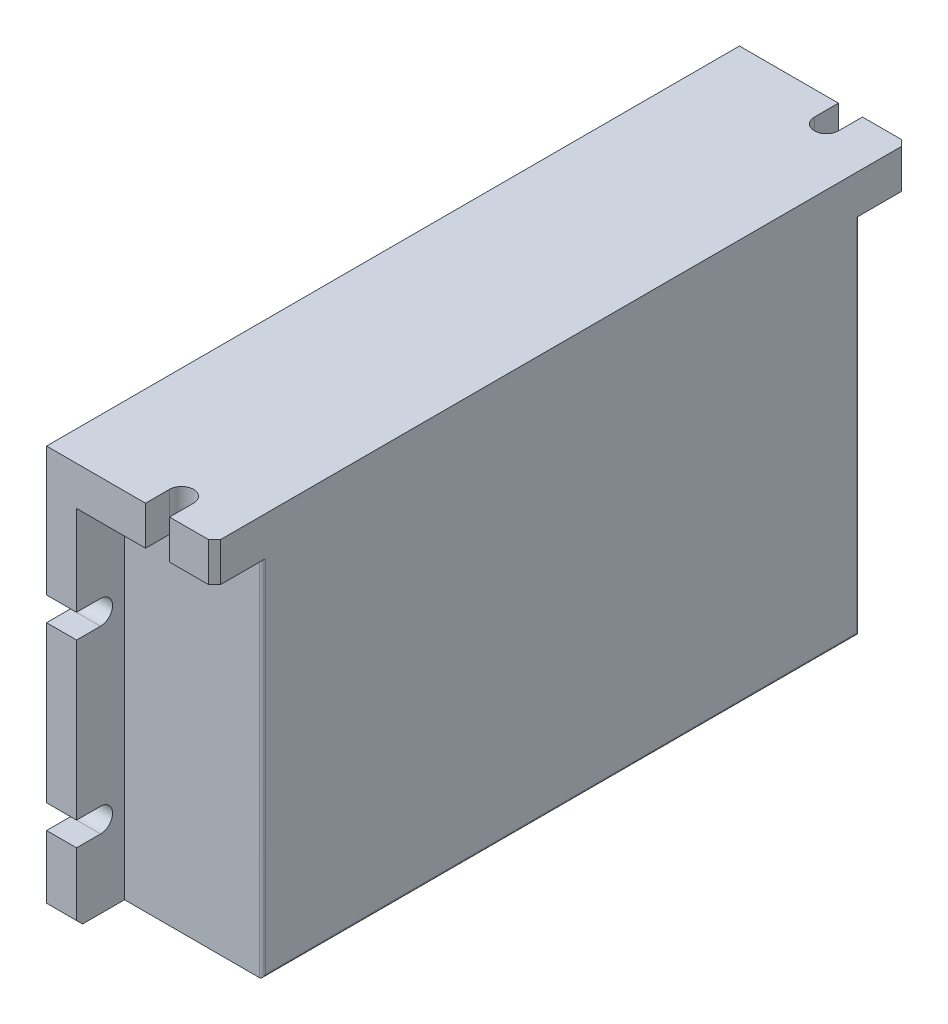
ISO-10303-21;
HEADER;
FILE_DESCRIPTION(('STEP AP214'),'2;1');
FILE_NAME('part.step','',(''),(''),'','','');
FILE_SCHEMA(('AUTOMOTIVE_DESIGN { 1 0 10303 214 1 1 1 1 }'));
ENDSEC;
DATA;
#1=APPLICATION_CONTEXT('core data for automotive mechanical design processes');
#2=APPLICATION_PROTOCOL_DEFINITION('international standard','automotive_design',2000,#1);
#3=PRODUCT_CONTEXT('',#1,'mechanical');
#4=PRODUCT('Part','Part','',(#3));
#5=PRODUCT_RELATED_PRODUCT_CATEGORY('part','',(#4));
#6=PRODUCT_DEFINITION_FORMATION('','',#4);
#7=PRODUCT_DEFINITION_CONTEXT('part definition',#1,'design');
#8=PRODUCT_DEFINITION('design','',#6,#7);
#9=PRODUCT_DEFINITION_SHAPE('','',#8);
#10=(LENGTH_UNIT() NAMED_UNIT(*) SI_UNIT(.MILLI.,.METRE.));
#11=(NAMED_UNIT(*) PLANE_ANGLE_UNIT() SI_UNIT($,.RADIAN.));
#12=(NAMED_UNIT(*) SI_UNIT($,.STERADIAN.) SOLID_ANGLE_UNIT());
#13=UNCERTAINTY_MEASURE_WITH_UNIT(LENGTH_MEASURE(1.E-05),#10,'distance_accuracy_value','');
#14=(GEOMETRIC_REPRESENTATION_CONTEXT(3) GLOBAL_UNCERTAINTY_ASSIGNED_CONTEXT((#13)) GLOBAL_UNIT_ASSIGNED_CONTEXT((#10,
#11,#12)) REPRESENTATION_CONTEXT('',''));
#15=CARTESIAN_POINT('',(0.,0.,0.));
#16=DIRECTION('',(0.,0.,1.));
#17=DIRECTION('',(1.,0.,0.));
#18=AXIS2_PLACEMENT_3D('',#15,#16,#17);
#19=CARTESIAN_POINT('',(28.,-33.5,-57.75));
#20=DIRECTION('',(0.,0.,1.));
#21=DIRECTION('',(1.,0.,0.));
#22=AXIS2_PLACEMENT_3D('',#19,#20,#21);
#23=PLANE('',#22);
#24=DIRECTION('',(0.,1.,0.));
#25=VECTOR('',#24,1.);
#26=CARTESIAN_POINT('',(5.,-33.5,-57.75));
#27=LINE('',#26,#25);
#28=CARTESIAN_POINT('',(5.,12.,-57.75));
#29=VERTEX_POINT('',#28);
#30=CARTESIAN_POINT('',(5.,27.,-57.75));
#31=VERTEX_POINT('',#30);
#32=EDGE_CURVE('E471',#29,#31,#27,.T.);
#33=ORIENTED_EDGE('',*,*,#32,.F.);
#34=DIRECTION('',(1.,0.,0.));
#35=VECTOR('',#34,1.);
#36=CARTESIAN_POINT('',(0.,12.,-57.75));
#37=LINE('',#36,#35);
#38=CARTESIAN_POINT('',(0.,12.,-57.75));
#39=VERTEX_POINT('',#38);
#40=EDGE_CURVE('E330',#39,#29,#37,.T.);
#41=ORIENTED_EDGE('',*,*,#40,.F.);
#42=DIRECTION('',(0.,1.,0.));
#43=VECTOR('',#42,1.);
#44=CARTESIAN_POINT('',(0.,-33.5,-57.75));
#45=LINE('',#44,#43);
#46=CARTESIAN_POINT('',(0.,33.5,-57.75));
#47=VERTEX_POINT('',#46);
#48=EDGE_CURVE('E510',#39,#47,#45,.T.);
#49=ORIENTED_EDGE('',*,*,#48,.T.);
#50=DIRECTION('',(-1.,0.,0.));
#51=VECTOR('',#50,1.);
#52=CARTESIAN_POINT('',(28.,33.5,-57.75));
#53=LINE('',#52,#51);
#54=CARTESIAN_POINT('',(16.5,33.5,-57.75));
#55=VERTEX_POINT('',#54);
#56=EDGE_CURVE('E537',#55,#47,#53,.T.);
#57=ORIENTED_EDGE('',*,*,#56,.F.);
#58=DIRECTION('',(0.,1.,0.));
#59=VECTOR('',#58,1.);
#60=CARTESIAN_POINT('',(16.5,27.,-57.75));
#61=LINE('',#60,#59);
#62=CARTESIAN_POINT('',(16.5,27.,-57.75));
#63=VERTEX_POINT('',#62);
#64=EDGE_CURVE('E461',#63,#55,#61,.T.);
#65=ORIENTED_EDGE('',*,*,#64,.F.);
#66=DIRECTION('',(1.,0.,0.));
#67=VECTOR('',#66,1.);
#68=CARTESIAN_POINT('',(5.,27.,-57.75));
#69=LINE('',#68,#67);
#70=EDGE_CURVE('E489',#31,#63,#69,.T.);
#71=ORIENTED_EDGE('',*,*,#70,.F.);
#72=EDGE_LOOP('',(#33,#41,#49,#57,#65,#71));
#73=FACE_BOUND('',#72,.T.);
#74=ADVANCED_FACE('F35',(#73),#23,.F.);
#75=CARTESIAN_POINT('',(0.,-18.,-57.75));
#76=VERTEX_POINT('',#75);
#77=CARTESIAN_POINT('',(0.,7.99999999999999,-57.75));
#78=VERTEX_POINT('',#77);
#79=EDGE_CURVE('E525',#76,#78,#45,.T.);
#80=ORIENTED_EDGE('',*,*,#79,.T.);
#81=DIRECTION('',(1.,0.,0.));
#82=VECTOR('',#81,1.);
#83=CARTESIAN_POINT('',(0.,7.99999999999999,-57.75));
#84=LINE('',#83,#82);
#85=CARTESIAN_POINT('',(5.,7.99999999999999,-57.75));
#86=VERTEX_POINT('',#85);
#87=EDGE_CURVE('E303',#78,#86,#84,.T.);
#88=ORIENTED_EDGE('',*,*,#87,.T.);
#89=CARTESIAN_POINT('',(5.,-18.,-57.75));
#90=VERTEX_POINT('',#89);
#91=EDGE_CURVE('E470',#90,#86,#27,.T.);
#92=ORIENTED_EDGE('',*,*,#91,.F.);
#93=DIRECTION('',(1.,0.,0.));
#94=VECTOR('',#93,1.);
#95=CARTESIAN_POINT('',(0.,-18.,-57.75));
#96=LINE('',#95,#94);
#97=EDGE_CURVE('E353',#76,#90,#96,.T.);
#98=ORIENTED_EDGE('',*,*,#97,.F.);
#99=EDGE_LOOP('',(#80,#88,#92,#98));
#100=FACE_BOUND('',#99,.T.);
#101=ADVANCED_FACE('F629',(#100),#23,.F.);
#102=CARTESIAN_POINT('',(28.,-33.5,57.75));
#103=DIRECTION('',(0.,0.,-1.));
#104=DIRECTION('',(-1.,0.,0.));
#105=AXIS2_PLACEMENT_3D('',#102,#103,#104);
#106=PLANE('',#105);
#107=DIRECTION('',(0.,-1.,0.));
#108=VECTOR('',#107,1.);
#109=CARTESIAN_POINT('',(5.,-33.5,57.75));
#110=LINE('',#109,#108);
#111=CARTESIAN_POINT('',(5.,7.99999999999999,57.75));
#112=VERTEX_POINT('',#111);
#113=CARTESIAN_POINT('',(5.,-18.,57.75));
#114=VERTEX_POINT('',#113);
#115=EDGE_CURVE('E496',#112,#114,#110,.T.);
#116=ORIENTED_EDGE('',*,*,#115,.F.);
#117=DIRECTION('',(1.,0.,0.));
#118=VECTOR('',#117,1.);
#119=CARTESIAN_POINT('',(0.,7.99999999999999,57.75));
#120=LINE('',#119,#118);
#121=CARTESIAN_POINT('',(0.,7.99999999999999,57.75));
#122=VERTEX_POINT('',#121);
#123=EDGE_CURVE('E379',#122,#112,#120,.T.);
#124=ORIENTED_EDGE('',*,*,#123,.F.);
#125=DIRECTION('',(0.,-1.,0.));
#126=VECTOR('',#125,1.);
#127=CARTESIAN_POINT('',(0.,-33.5,57.75));
#128=LINE('',#127,#126);
#129=CARTESIAN_POINT('',(0.,-18.,57.75));
#130=VERTEX_POINT('',#129);
#131=EDGE_CURVE('E532',#122,#130,#128,.T.);
#132=ORIENTED_EDGE('',*,*,#131,.T.);
#133=DIRECTION('',(1.,0.,0.));
#134=VECTOR('',#133,1.);
#135=CARTESIAN_POINT('',(0.,-18.,57.75));
#136=LINE('',#135,#134);
#137=EDGE_CURVE('E408',#130,#114,#136,.T.);
#138=ORIENTED_EDGE('',*,*,#137,.T.);
#139=EDGE_LOOP('',(#116,#124,#132,#138));
#140=FACE_BOUND('',#139,.T.);
#141=ADVANCED_FACE('F703',(#140),#106,.F.);
#142=CARTESIAN_POINT('',(0.,-22.,57.75));
#143=VERTEX_POINT('',#142);
#144=CARTESIAN_POINT('',(0.,-32.5,57.75));
#145=VERTEX_POINT('',#144);
#146=EDGE_CURVE('E528',#143,#145,#128,.T.);
#147=ORIENTED_EDGE('',*,*,#146,.T.);
#148=DIRECTION('',(1.,0.,0.));
#149=VECTOR('',#148,1.);
#150=CARTESIAN_POINT('',(28.,-32.5,57.75));
#151=LINE('',#150,#149);
#152=CARTESIAN_POINT('',(5.,-32.5,57.75));
#153=VERTEX_POINT('',#152);
#154=EDGE_CURVE('E578',#145,#153,#151,.T.);
#155=ORIENTED_EDGE('',*,*,#154,.T.);
#156=CARTESIAN_POINT('',(5.,-22.,57.75));
#157=VERTEX_POINT('',#156);
#158=EDGE_CURVE('E497',#157,#153,#110,.T.);
#159=ORIENTED_EDGE('',*,*,#158,.F.);
#160=DIRECTION('',(1.,0.,0.));
#161=VECTOR('',#160,1.);
#162=CARTESIAN_POINT('',(0.,-22.,57.75));
#163=LINE('',#162,#161);
#164=EDGE_CURVE('E406',#143,#157,#163,.T.);
#165=ORIENTED_EDGE('',*,*,#164,.F.);
#166=EDGE_LOOP('',(#147,#155,#159,#165));
#167=FACE_BOUND('',#166,.T.);
#168=ADVANCED_FACE('F718',(#167),#106,.F.);
#169=DIRECTION('',(1.,0.,0.));
#170=VECTOR('',#169,1.);
#171=CARTESIAN_POINT('',(5.,27.,57.75));
#172=LINE('',#171,#170);
#173=CARTESIAN_POINT('',(20.5,27.,57.75));
#174=VERTEX_POINT('',#173);
#175=CARTESIAN_POINT('',(27.,27.,57.75));
#176=VERTEX_POINT('',#175);
#177=EDGE_CURVE('E511',#174,#176,#172,.T.);
#178=ORIENTED_EDGE('',*,*,#177,.T.);
#179=DIRECTION('',(0.,1.,0.));
#180=VECTOR('',#179,1.);
#181=CARTESIAN_POINT('',(27.,-33.5,57.75));
#182=LINE('',#181,#180);
#183=CARTESIAN_POINT('',(27.,33.5,57.75));
#184=VERTEX_POINT('',#183);
#185=EDGE_CURVE('E11',#176,#184,#182,.T.);
#186=ORIENTED_EDGE('',*,*,#185,.T.);
#187=DIRECTION('',(-1.,0.,0.));
#188=VECTOR('',#187,1.);
#189=CARTESIAN_POINT('',(28.,33.5,57.75));
#190=LINE('',#189,#188);
#191=CARTESIAN_POINT('',(20.5,33.5,57.75));
#192=VERTEX_POINT('',#191);
#193=EDGE_CURVE('E535',#184,#192,#190,.T.);
#194=ORIENTED_EDGE('',*,*,#193,.T.);
#195=DIRECTION('',(0.,1.,0.));
#196=VECTOR('',#195,1.);
#197=CARTESIAN_POINT('',(20.5,27.,57.75));
#198=LINE('',#197,#196);
#199=EDGE_CURVE('E433',#174,#192,#198,.T.);
#200=ORIENTED_EDGE('',*,*,#199,.F.);
#201=EDGE_LOOP('',(#178,#186,#194,#200));
#202=FACE_BOUND('',#201,.T.);
#203=ADVANCED_FACE('F749',(#202),#106,.F.);
#204=CARTESIAN_POINT('',(5.,-32.5,-57.75));
#205=VERTEX_POINT('',#204);
#206=CARTESIAN_POINT('',(5.,-22.,-57.75));
#207=VERTEX_POINT('',#206);
#208=EDGE_CURVE('E467',#205,#207,#27,.T.);
#209=ORIENTED_EDGE('',*,*,#208,.F.);
#210=DIRECTION('',(-1.,0.,0.));
#211=VECTOR('',#210,1.);
#212=CARTESIAN_POINT('',(28.,-32.5,-57.75));
#213=LINE('',#212,#211);
#214=CARTESIAN_POINT('',(0.,-32.5,-57.75));
#215=VERTEX_POINT('',#214);
#216=EDGE_CURVE('E559',#205,#215,#213,.T.);
#217=ORIENTED_EDGE('',*,*,#216,.T.);
#218=CARTESIAN_POINT('',(0.,-22.,-57.75));
#219=VERTEX_POINT('',#218);
#220=EDGE_CURVE('E522',#215,#219,#45,.T.);
#221=ORIENTED_EDGE('',*,*,#220,.T.);
#222=DIRECTION('',(1.,0.,0.));
#223=VECTOR('',#222,1.);
#224=CARTESIAN_POINT('',(0.,-22.,-57.75));
#225=LINE('',#224,#223);
#226=EDGE_CURVE('E355',#219,#207,#225,.T.);
#227=ORIENTED_EDGE('',*,*,#226,.T.);
#228=EDGE_LOOP('',(#209,#217,#221,#227));
#229=FACE_BOUND('',#228,.T.);
#230=ADVANCED_FACE('F647',(#229),#23,.F.);
#231=CARTESIAN_POINT('',(27.,33.5,-57.75));
#232=VERTEX_POINT('',#231);
#233=CARTESIAN_POINT('',(20.5,33.5,-57.75));
#234=VERTEX_POINT('',#233);
#235=EDGE_CURVE('E538',#232,#234,#53,.T.);
#236=ORIENTED_EDGE('',*,*,#235,.F.);
#237=DIRECTION('',(0.,-1.,0.));
#238=VECTOR('',#237,1.);
#239=CARTESIAN_POINT('',(27.,-33.5,-57.75));
#240=LINE('',#239,#238);
#241=CARTESIAN_POINT('',(27.,27.,-57.75));
#242=VERTEX_POINT('',#241);
#243=EDGE_CURVE('E57',#232,#242,#240,.T.);
#244=ORIENTED_EDGE('',*,*,#243,.T.);
#245=CARTESIAN_POINT('',(20.5,27.,-57.75));
#246=VERTEX_POINT('',#245);
#247=EDGE_CURVE('E480',#246,#242,#69,.T.);
#248=ORIENTED_EDGE('',*,*,#247,.F.);
#249=DIRECTION('',(0.,1.,0.));
#250=VECTOR('',#249,1.);
#251=CARTESIAN_POINT('',(20.5,27.,-57.75));
#252=LINE('',#251,#250);
#253=EDGE_CURVE('E463',#246,#234,#252,.T.);
#254=ORIENTED_EDGE('',*,*,#253,.T.);
#255=EDGE_LOOP('',(#236,#244,#248,#254));
#256=FACE_BOUND('',#255,.T.);
#257=ADVANCED_FACE('F609',(#256),#23,.F.);
#258=CARTESIAN_POINT('',(28.,33.5,57.75));
#259=DIRECTION('',(0.,-1.,0.));
#260=DIRECTION('',(0.,0.,-1.));
#261=AXIS2_PLACEMENT_3D('',#258,#259,#260);
#262=PLANE('',#261);
#263=DIRECTION('',(0.,0.,1.));
#264=VECTOR('',#263,1.);
#265=CARTESIAN_POINT('',(28.,33.5,57.75));
#266=LINE('',#265,#264);
#267=CARTESIAN_POINT('',(28.,33.5,-56.7499999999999));
#268=VERTEX_POINT('',#267);
#269=CARTESIAN_POINT('',(28.,33.5,56.75));
#270=VERTEX_POINT('',#269);
#271=EDGE_CURVE('E517',#268,#270,#266,.T.);
#272=ORIENTED_EDGE('',*,*,#271,.F.);
#273=DIRECTION('',(0.707106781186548,0.,0.707106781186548));
#274=VECTOR('',#273,1.);
#275=CARTESIAN_POINT('',(28.,33.5,-56.75));
#276=LINE('',#275,#274);
#277=EDGE_CURVE('E590',#268,#232,#276,.F.);
#278=ORIENTED_EDGE('',*,*,#277,.T.);
#279=ORIENTED_EDGE('',*,*,#235,.T.);
#280=DIRECTION('',(0.,0.,-1.));
#281=VECTOR('',#280,1.);
#282=CARTESIAN_POINT('',(20.5,33.5,-57.75));
#283=LINE('',#282,#281);
#284=CARTESIAN_POINT('',(20.5,33.5,-53.75));
#285=VERTEX_POINT('',#284);
#286=EDGE_CURVE('E453',#285,#234,#283,.T.);
#287=ORIENTED_EDGE('',*,*,#286,.F.);
#288=CARTESIAN_POINT('',(18.5,33.5,-53.75));
#289=DIRECTION('',(0.,1.,0.));
#290=DIRECTION('',(0.,0.,1.));
#291=AXIS2_PLACEMENT_3D('',#288,#289,#290);
#292=CIRCLE('',#291,2.);
#293=CARTESIAN_POINT('',(16.5,33.5,-53.75));
#294=VERTEX_POINT('',#293);
#295=EDGE_CURVE('E432',#294,#285,#292,.T.);
#296=ORIENTED_EDGE('',*,*,#295,.F.);
#297=DIRECTION('',(0.,0.,1.));
#298=VECTOR('',#297,1.);
#299=CARTESIAN_POINT('',(16.5,33.5,-53.75));
#300=LINE('',#299,#298);
#301=EDGE_CURVE('E444',#55,#294,#300,.T.);
#302=ORIENTED_EDGE('',*,*,#301,.F.);
#303=ORIENTED_EDGE('',*,*,#56,.T.);
#304=DIRECTION('',(0.,0.,1.));
#305=VECTOR('',#304,1.);
#306=CARTESIAN_POINT('',(0.,33.5,57.75));
#307=LINE('',#306,#305);
#308=CARTESIAN_POINT('',(0.,33.5,57.75));
#309=VERTEX_POINT('',#308);
#310=EDGE_CURVE('E524',#47,#309,#307,.T.);
#311=ORIENTED_EDGE('',*,*,#310,.T.);
#312=CARTESIAN_POINT('',(16.5,33.5,57.75));
#313=VERTEX_POINT('',#312);
#314=EDGE_CURVE('E520',#313,#309,#190,.T.);
#315=ORIENTED_EDGE('',*,*,#314,.F.);
#316=DIRECTION('',(0.,0.,1.));
#317=VECTOR('',#316,1.);
#318=CARTESIAN_POINT('',(16.5,33.5,53.75));
#319=LINE('',#318,#317);
#320=CARTESIAN_POINT('',(16.5,33.5,53.75));
#321=VERTEX_POINT('',#320);
#322=EDGE_CURVE('E426',#321,#313,#319,.T.);
#323=ORIENTED_EDGE('',*,*,#322,.F.);
#324=CARTESIAN_POINT('',(18.5,33.5,53.75));
#325=DIRECTION('',(0.,1.,0.));
#326=DIRECTION('',(0.,0.,1.));
#327=AXIS2_PLACEMENT_3D('',#324,#325,#326);
#328=CIRCLE('',#327,2.);
#329=CARTESIAN_POINT('',(20.5,33.5,53.75));
#330=VERTEX_POINT('',#329);
#331=EDGE_CURVE('E405',#330,#321,#328,.T.);
#332=ORIENTED_EDGE('',*,*,#331,.F.);
#333=DIRECTION('',(0.,0.,-1.));
#334=VECTOR('',#333,1.);
#335=CARTESIAN_POINT('',(20.5,33.5,57.75));
#336=LINE('',#335,#334);
#337=EDGE_CURVE('E417',#192,#330,#336,.T.);
#338=ORIENTED_EDGE('',*,*,#337,.F.);
#339=ORIENTED_EDGE('',*,*,#193,.F.);
#340=DIRECTION('',(-0.707106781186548,0.,0.707106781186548));
#341=VECTOR('',#340,1.);
#342=CARTESIAN_POINT('',(28.,33.5,56.75));
#343=LINE('',#342,#341);
#344=EDGE_CURVE('E588',#184,#270,#343,.F.);
#345=ORIENTED_EDGE('',*,*,#344,.T.);
#346=EDGE_LOOP('',(#272,#278,#279,#287,#296,#302,#303,#311,#315,#323,#332,#338,#339,#345));
#347=FACE_BOUND('',#346,.T.);
#348=ADVANCED_FACE('F607',(#347),#262,.F.);
#349=CARTESIAN_POINT('',(0.,12.,57.75));
#350=VERTEX_POINT('',#349);
#351=EDGE_CURVE('E529',#309,#350,#128,.T.);
#352=ORIENTED_EDGE('',*,*,#351,.T.);
#353=DIRECTION('',(1.,0.,0.));
#354=VECTOR('',#353,1.);
#355=CARTESIAN_POINT('',(0.,12.,57.75));
#356=LINE('',#355,#354);
#357=CARTESIAN_POINT('',(5.,12.,57.75));
#358=VERTEX_POINT('',#357);
#359=EDGE_CURVE('E381',#350,#358,#356,.T.);
#360=ORIENTED_EDGE('',*,*,#359,.T.);
#361=CARTESIAN_POINT('',(5.,27.,57.75));
#362=VERTEX_POINT('',#361);
#363=EDGE_CURVE('E492',#362,#358,#110,.T.);
#364=ORIENTED_EDGE('',*,*,#363,.F.);
#365=CARTESIAN_POINT('',(16.5,27.,57.75));
#366=VERTEX_POINT('',#365);
#367=EDGE_CURVE('E507',#362,#366,#172,.T.);
#368=ORIENTED_EDGE('',*,*,#367,.T.);
#369=DIRECTION('',(0.,1.,0.));
#370=VECTOR('',#369,1.);
#371=CARTESIAN_POINT('',(16.5,27.,57.75));
#372=LINE('',#371,#370);
#373=EDGE_CURVE('E436',#366,#313,#372,.T.);
#374=ORIENTED_EDGE('',*,*,#373,.T.);
#375=ORIENTED_EDGE('',*,*,#314,.T.);
#376=EDGE_LOOP('',(#352,#360,#364,#368,#374,#375));
#377=FACE_BOUND('',#376,.T.);
#378=ADVANCED_FACE('F687',(#377),#106,.F.);
#379=CARTESIAN_POINT('',(28.,-33.5,57.75));
#380=DIRECTION('',(0.,1.,0.));
#381=DIRECTION('',(0.,0.,1.));
#382=AXIS2_PLACEMENT_3D('',#379,#380,#381);
#383=PLANE('',#382);
#384=DIRECTION('',(0.,0.,-1.));
#385=VECTOR('',#384,1.);
#386=CARTESIAN_POINT('',(0.,-33.5,57.75));
#387=LINE('',#386,#385);
#388=CARTESIAN_POINT('',(0.,-33.5,56.75));
#389=VERTEX_POINT('',#388);
#390=CARTESIAN_POINT('',(0.,-33.5,-56.75));
#391=VERTEX_POINT('',#390);
#392=EDGE_CURVE('E521',#389,#391,#387,.T.);
#393=ORIENTED_EDGE('',*,*,#392,.T.);
#394=DIRECTION('',(1.,0.,0.));
#395=VECTOR('',#394,1.);
#396=CARTESIAN_POINT('',(28.,-33.5,-56.75));
#397=LINE('',#396,#395);
#398=CARTESIAN_POINT('',(5.,-33.5,-56.75));
#399=VERTEX_POINT('',#398);
#400=EDGE_CURVE('E574',#391,#399,#397,.T.);
#401=ORIENTED_EDGE('',*,*,#400,.T.);
#402=DIRECTION('',(0.,0.,-1.));
#403=VECTOR('',#402,1.);
#404=CARTESIAN_POINT('',(5.,-33.5,-49.75));
#405=LINE('',#404,#403);
#406=CARTESIAN_POINT('',(5.,-33.5,-49.75));
#407=VERTEX_POINT('',#406);
#408=EDGE_CURVE('E477',#407,#399,#405,.T.);
#409=ORIENTED_EDGE('',*,*,#408,.F.);
#410=DIRECTION('',(1.,0.,0.));
#411=VECTOR('',#410,1.);
#412=CARTESIAN_POINT('',(5.,-33.5,-49.75));
#413=LINE('',#412,#411);
#414=CARTESIAN_POINT('',(27.5,-33.5,-49.75));
#415=VERTEX_POINT('',#414);
#416=EDGE_CURVE('E482',#407,#415,#413,.T.);
#417=ORIENTED_EDGE('',*,*,#416,.T.);
#418=DIRECTION('',(0.,0.,-1.));
#419=VECTOR('',#418,1.);
#420=CARTESIAN_POINT('',(27.5,-33.5,57.75));
#421=LINE('',#420,#419);
#422=CARTESIAN_POINT('',(27.5,-33.5,49.75));
#423=VERTEX_POINT('',#422);
#424=EDGE_CURVE('E552',#415,#423,#421,.F.);
#425=ORIENTED_EDGE('',*,*,#424,.T.);
#426=DIRECTION('',(1.,0.,0.));
#427=VECTOR('',#426,1.);
#428=CARTESIAN_POINT('',(5.,-33.5,49.75));
#429=LINE('',#428,#427);
#430=CARTESIAN_POINT('',(5.,-33.5,49.75));
#431=VERTEX_POINT('',#430);
#432=EDGE_CURVE('E505',#431,#423,#429,.T.);
#433=ORIENTED_EDGE('',*,*,#432,.F.);
#434=DIRECTION('',(0.,0.,-1.));
#435=VECTOR('',#434,1.);
#436=CARTESIAN_POINT('',(5.,-33.5,49.75));
#437=LINE('',#436,#435);
#438=CARTESIAN_POINT('',(5.,-33.5,56.75));
#439=VERTEX_POINT('',#438);
#440=EDGE_CURVE('E495',#439,#431,#437,.T.);
#441=ORIENTED_EDGE('',*,*,#440,.F.);
#442=DIRECTION('',(-1.,0.,0.));
#443=VECTOR('',#442,1.);
#444=CARTESIAN_POINT('',(28.,-33.5,56.75));
#445=LINE('',#444,#443);
#446=EDGE_CURVE('E571',#439,#389,#445,.T.);
#447=ORIENTED_EDGE('',*,*,#446,.T.);
#448=EDGE_LOOP('',(#393,#401,#409,#417,#425,#433,#441,#447));
#449=FACE_BOUND('',#448,.T.);
#450=ADVANCED_FACE('F655',(#449),#383,.F.);
#451=CARTESIAN_POINT('',(28.,0.,0.));
#452=DIRECTION('',(-1.,0.,0.));
#453=DIRECTION('',(0.,0.,1.));
#454=AXIS2_PLACEMENT_3D('',#451,#452,#453);
#455=PLANE('',#454);
#456=DIRECTION('',(0.,0.,1.));
#457=VECTOR('',#456,1.);
#458=CARTESIAN_POINT('',(28.,27.,-57.75));
#459=LINE('',#458,#457);
#460=CARTESIAN_POINT('',(28.,27.,-56.75));
#461=VERTEX_POINT('',#460);
#462=CARTESIAN_POINT('',(28.,27.,-49.25));
#463=VERTEX_POINT('',#462);
#464=EDGE_CURVE('E460',#461,#463,#459,.T.);
#465=ORIENTED_EDGE('',*,*,#464,.F.);
#466=DIRECTION('',(0.,1.,0.));
#467=VECTOR('',#466,1.);
#468=CARTESIAN_POINT('',(28.,0.,-56.75));
#469=LINE('',#468,#467);
#470=EDGE_CURVE('E585',#461,#268,#469,.T.);
#471=ORIENTED_EDGE('',*,*,#470,.T.);
#472=ORIENTED_EDGE('',*,*,#271,.T.);
#473=DIRECTION('',(0.,-1.,0.));
#474=VECTOR('',#473,1.);
#475=CARTESIAN_POINT('',(28.,0.,56.75));
#476=LINE('',#475,#474);
#477=CARTESIAN_POINT('',(28.,27.,56.75));
#478=VERTEX_POINT('',#477);
#479=EDGE_CURVE('E582',#270,#478,#476,.T.);
#480=ORIENTED_EDGE('',*,*,#479,.T.);
#481=DIRECTION('',(0.,0.,1.));
#482=VECTOR('',#481,1.);
#483=CARTESIAN_POINT('',(28.,27.,57.75));
#484=LINE('',#483,#482);
#485=CARTESIAN_POINT('',(28.,27.,49.25));
#486=VERTEX_POINT('',#485);
#487=EDGE_CURVE('E485',#486,#478,#484,.T.);
#488=ORIENTED_EDGE('',*,*,#487,.F.);
#489=DIRECTION('',(0.,1.,0.));
#490=VECTOR('',#489,1.);
#491=CARTESIAN_POINT('',(28.,0.,49.25));
#492=LINE('',#491,#490);
#493=CARTESIAN_POINT('',(28.,-33.,49.25));
#494=VERTEX_POINT('',#493);
#495=EDGE_CURVE('E548',#486,#494,#492,.F.);
#496=ORIENTED_EDGE('',*,*,#495,.T.);
#497=DIRECTION('',(0.,0.,-1.));
#498=VECTOR('',#497,1.);
#499=CARTESIAN_POINT('',(28.,-33.,0.));
#500=LINE('',#499,#498);
#501=CARTESIAN_POINT('',(28.,-33.,-49.25));
#502=VERTEX_POINT('',#501);
#503=EDGE_CURVE('E543',#494,#502,#500,.T.);
#504=ORIENTED_EDGE('',*,*,#503,.T.);
#505=DIRECTION('',(0.,-1.,0.));
#506=VECTOR('',#505,1.);
#507=CARTESIAN_POINT('',(28.,0.,-49.25));
#508=LINE('',#507,#506);
#509=EDGE_CURVE('E545',#502,#463,#508,.F.);
#510=ORIENTED_EDGE('',*,*,#509,.T.);
#511=EDGE_LOOP('',(#465,#471,#472,#480,#488,#496,#504,#510));
#512=FACE_BOUND('',#511,.T.);
#513=ADVANCED_FACE('F601',(#512),#455,.F.);
#514=CARTESIAN_POINT('',(0.,0.,0.));
#515=DIRECTION('',(-1.,0.,0.));
#516=DIRECTION('',(0.,0.,1.));
#517=AXIS2_PLACEMENT_3D('',#514,#515,#516);
#518=PLANE('',#517);
#519=ORIENTED_EDGE('',*,*,#220,.F.);
#520=DIRECTION('',(0.,0.707106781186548,-0.707106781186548));
#521=VECTOR('',#520,1.);
#522=CARTESIAN_POINT('',(0.,-45.125,-45.125));
#523=LINE('',#522,#521);
#524=EDGE_CURVE('E569',#215,#391,#523,.F.);
#525=ORIENTED_EDGE('',*,*,#524,.T.);
#526=ORIENTED_EDGE('',*,*,#392,.F.);
#527=DIRECTION('',(0.,-0.707106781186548,-0.707106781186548));
#528=VECTOR('',#527,1.);
#529=CARTESIAN_POINT('',(0.,-45.125,45.125));
#530=LINE('',#529,#528);
#531=EDGE_CURVE('E567',#389,#145,#530,.F.);
#532=ORIENTED_EDGE('',*,*,#531,.T.);
#533=ORIENTED_EDGE('',*,*,#146,.F.);
#534=DIRECTION('',(0.,0.,-1.));
#535=VECTOR('',#534,1.);
#536=CARTESIAN_POINT('',(0.,-22.,57.75));
#537=LINE('',#536,#535);
#538=CARTESIAN_POINT('',(0.,-22.,53.75));
#539=VERTEX_POINT('',#538);
#540=EDGE_CURVE('E393',#143,#539,#537,.T.);
#541=ORIENTED_EDGE('',*,*,#540,.T.);
#542=CARTESIAN_POINT('',(0.,-20.,53.75));
#543=DIRECTION('',(1.,0.,0.));
#544=DIRECTION('',(0.,0.,-1.));
#545=AXIS2_PLACEMENT_3D('',#542,#543,#544);
#546=CIRCLE('',#545,2.);
#547=CARTESIAN_POINT('',(0.,-18.,53.75));
#548=VERTEX_POINT('',#547);
#549=EDGE_CURVE('E386',#539,#548,#546,.T.);
#550=ORIENTED_EDGE('',*,*,#549,.T.);
#551=DIRECTION('',(0.,0.,1.));
#552=VECTOR('',#551,1.);
#553=CARTESIAN_POINT('',(0.,-18.,53.75));
#554=LINE('',#553,#552);
#555=EDGE_CURVE('E389',#548,#130,#554,.T.);
#556=ORIENTED_EDGE('',*,*,#555,.T.);
#557=ORIENTED_EDGE('',*,*,#131,.F.);
#558=DIRECTION('',(0.,0.,-1.));
#559=VECTOR('',#558,1.);
#560=CARTESIAN_POINT('',(0.,7.99999999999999,53.75));
#561=LINE('',#560,#559);
#562=CARTESIAN_POINT('',(0.,7.99999999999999,53.75));
#563=VERTEX_POINT('',#562);
#564=EDGE_CURVE('E367',#122,#563,#561,.T.);
#565=ORIENTED_EDGE('',*,*,#564,.T.);
#566=CARTESIAN_POINT('',(0.,9.99999999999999,53.75));
#567=DIRECTION('',(1.,0.,0.));
#568=DIRECTION('',(0.,0.,-1.));
#569=AXIS2_PLACEMENT_3D('',#566,#567,#568);
#570=CIRCLE('',#569,2.);
#571=CARTESIAN_POINT('',(0.,12.,53.75));
#572=VERTEX_POINT('',#571);
#573=EDGE_CURVE('E360',#563,#572,#570,.T.);
#574=ORIENTED_EDGE('',*,*,#573,.T.);
#575=DIRECTION('',(0.,0.,1.));
#576=VECTOR('',#575,1.);
#577=CARTESIAN_POINT('',(0.,12.,57.75));
#578=LINE('',#577,#576);
#579=EDGE_CURVE('E363',#572,#350,#578,.T.);
#580=ORIENTED_EDGE('',*,*,#579,.T.);
#581=ORIENTED_EDGE('',*,*,#351,.F.);
#582=ORIENTED_EDGE('',*,*,#310,.F.);
#583=ORIENTED_EDGE('',*,*,#48,.F.);
#584=DIRECTION('',(0.,0.,1.));
#585=VECTOR('',#584,1.);
#586=CARTESIAN_POINT('',(0.,12.,-53.75));
#587=LINE('',#586,#585);
#588=CARTESIAN_POINT('',(0.,12.,-53.75));
#589=VERTEX_POINT('',#588);
#590=EDGE_CURVE('E304',#39,#589,#587,.T.);
#591=ORIENTED_EDGE('',*,*,#590,.T.);
#592=CARTESIAN_POINT('',(0.,9.99999999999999,-53.75));
#593=DIRECTION('',(1.,0.,0.));
#594=DIRECTION('',(0.,0.,-1.));
#595=AXIS2_PLACEMENT_3D('',#592,#593,#594);
#596=CIRCLE('',#595,2.);
#597=CARTESIAN_POINT('',(0.,7.99999999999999,-53.75));
#598=VERTEX_POINT('',#597);
#599=EDGE_CURVE('E297',#589,#598,#596,.T.);
#600=ORIENTED_EDGE('',*,*,#599,.T.);
#601=DIRECTION('',(0.,0.,-1.));
#602=VECTOR('',#601,1.);
#603=CARTESIAN_POINT('',(0.,7.99999999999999,-57.75));
#604=LINE('',#603,#602);
#605=EDGE_CURVE('E307',#598,#78,#604,.T.);
#606=ORIENTED_EDGE('',*,*,#605,.T.);
#607=ORIENTED_EDGE('',*,*,#79,.F.);
#608=DIRECTION('',(0.,0.,1.));
#609=VECTOR('',#608,1.);
#610=CARTESIAN_POINT('',(0.,-18.,-53.75));
#611=LINE('',#610,#609);
#612=CARTESIAN_POINT('',(0.,-18.,-53.75));
#613=VERTEX_POINT('',#612);
#614=EDGE_CURVE('E340',#76,#613,#611,.T.);
#615=ORIENTED_EDGE('',*,*,#614,.T.);
#616=CARTESIAN_POINT('',(0.,-20.,-53.75));
#617=DIRECTION('',(1.,0.,0.));
#618=DIRECTION('',(0.,0.,-1.));
#619=AXIS2_PLACEMENT_3D('',#616,#617,#618);
#620=CIRCLE('',#619,2.);
#621=CARTESIAN_POINT('',(0.,-22.,-53.75));
#622=VERTEX_POINT('',#621);
#623=EDGE_CURVE('E333',#613,#622,#620,.T.);
#624=ORIENTED_EDGE('',*,*,#623,.T.);
#625=DIRECTION('',(0.,0.,-1.));
#626=VECTOR('',#625,1.);
#627=CARTESIAN_POINT('',(0.,-22.,-57.75));
#628=LINE('',#627,#626);
#629=EDGE_CURVE('E336',#622,#219,#628,.T.);
#630=ORIENTED_EDGE('',*,*,#629,.T.);
#631=EDGE_LOOP('',(#519,#525,#526,#532,#533,#541,#550,#556,#557,#565,#574,#580,#581,#582,#583,
#591,#600,#606,#607,#615,#624,#630));
#632=FACE_BOUND('',#631,.T.);
#633=ADVANCED_FACE('F315',(#632),#518,.T.);
#634=CARTESIAN_POINT('',(5.,27.,57.75));
#635=DIRECTION('',(0.,1.,0.));
#636=DIRECTION('',(0.,0.,1.));
#637=AXIS2_PLACEMENT_3D('',#634,#635,#636);
#638=PLANE('',#637);
#639=ORIENTED_EDGE('',*,*,#487,.T.);
#640=DIRECTION('',(0.707106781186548,0.,-0.707106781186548));
#641=VECTOR('',#640,1.);
#642=CARTESIAN_POINT('',(28.,27.,56.75));
#643=LINE('',#642,#641);
#644=EDGE_CURVE('E43',#478,#176,#643,.F.);
#645=ORIENTED_EDGE('',*,*,#644,.T.);
#646=ORIENTED_EDGE('',*,*,#177,.F.);
#647=DIRECTION('',(0.,0.,-1.));
#648=VECTOR('',#647,1.);
#649=CARTESIAN_POINT('',(20.5,27.,57.75));
#650=LINE('',#649,#648);
#651=CARTESIAN_POINT('',(20.5,27.,53.75));
#652=VERTEX_POINT('',#651);
#653=EDGE_CURVE('E420',#174,#652,#650,.T.);
#654=ORIENTED_EDGE('',*,*,#653,.T.);
#655=CARTESIAN_POINT('',(18.5,27.,53.75));
#656=DIRECTION('',(0.,1.,0.));
#657=DIRECTION('',(0.,0.,1.));
#658=AXIS2_PLACEMENT_3D('',#655,#656,#657);
#659=CIRCLE('',#658,2.);
#660=CARTESIAN_POINT('',(16.5,27.,53.75));
#661=VERTEX_POINT('',#660);
#662=EDGE_CURVE('E413',#652,#661,#659,.T.);
#663=ORIENTED_EDGE('',*,*,#662,.T.);
#664=DIRECTION('',(0.,0.,1.));
#665=VECTOR('',#664,1.);
#666=CARTESIAN_POINT('',(16.5,27.,53.75));
#667=LINE('',#666,#665);
#668=EDGE_CURVE('E416',#661,#366,#667,.T.);
#669=ORIENTED_EDGE('',*,*,#668,.T.);
#670=ORIENTED_EDGE('',*,*,#367,.F.);
#671=DIRECTION('',(0.,0.,1.));
#672=VECTOR('',#671,1.);
#673=CARTESIAN_POINT('',(5.,27.,57.75));
#674=LINE('',#673,#672);
#675=CARTESIAN_POINT('',(5.,27.,49.75));
#676=VERTEX_POINT('',#675);
#677=EDGE_CURVE('E502',#676,#362,#674,.T.);
#678=ORIENTED_EDGE('',*,*,#677,.F.);
#679=DIRECTION('',(1.,0.,0.));
#680=VECTOR('',#679,1.);
#681=CARTESIAN_POINT('',(5.,27.,49.75));
#682=LINE('',#681,#680);
#683=CARTESIAN_POINT('',(27.5,27.,49.75));
#684=VERTEX_POINT('',#683);
#685=EDGE_CURVE('E512',#676,#684,#682,.T.);
#686=ORIENTED_EDGE('',*,*,#685,.T.);
#687=CARTESIAN_POINT('',(27.5,27.,49.25));
#688=DIRECTION('',(0.,1.,0.));
#689=DIRECTION('',(0.,0.,1.));
#690=AXIS2_PLACEMENT_3D('',#687,#688,#689);
#691=CIRCLE('',#690,0.5);
#692=EDGE_CURVE('E554',#684,#486,#691,.T.);
#693=ORIENTED_EDGE('',*,*,#692,.T.);
#694=EDGE_LOOP('',(#639,#645,#646,#654,#663,#669,#670,#678,#686,#693));
#695=FACE_BOUND('',#694,.T.);
#696=ADVANCED_FACE('F680',(#695),#638,.F.);
#697=CARTESIAN_POINT('',(5.,27.,49.75));
#698=DIRECTION('',(0.,0.,-1.));
#699=DIRECTION('',(-1.,0.,0.));
#700=AXIS2_PLACEMENT_3D('',#697,#698,#699);
#701=PLANE('',#700);
#702=ORIENTED_EDGE('',*,*,#432,.T.);
#703=DIRECTION('',(0.,1.,0.));
#704=VECTOR('',#703,1.);
#705=CARTESIAN_POINT('',(27.5,27.,49.75));
#706=LINE('',#705,#704);
#707=EDGE_CURVE('E540',#423,#684,#706,.T.);
#708=ORIENTED_EDGE('',*,*,#707,.T.);
#709=ORIENTED_EDGE('',*,*,#685,.F.);
#710=DIRECTION('',(0.,1.,0.));
#711=VECTOR('',#710,1.);
#712=CARTESIAN_POINT('',(5.,27.,49.75));
#713=LINE('',#712,#711);
#714=EDGE_CURVE('E499',#431,#676,#713,.T.);
#715=ORIENTED_EDGE('',*,*,#714,.F.);
#716=EDGE_LOOP('',(#702,#708,#709,#715));
#717=FACE_BOUND('',#716,.T.);
#718=ADVANCED_FACE('F677',(#717),#701,.F.);
#719=CARTESIAN_POINT('',(5.,0.,0.));
#720=DIRECTION('',(-1.,0.,0.));
#721=DIRECTION('',(0.,0.,1.));
#722=AXIS2_PLACEMENT_3D('',#719,#720,#721);
#723=PLANE('',#722);
#724=ORIENTED_EDGE('',*,*,#158,.T.);
#725=DIRECTION('',(0.,0.707106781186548,0.707106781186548));
#726=VECTOR('',#725,1.);
#727=CARTESIAN_POINT('',(5.,-33.5,56.75));
#728=LINE('',#727,#726);
#729=EDGE_CURVE('E580',#153,#439,#728,.F.);
#730=ORIENTED_EDGE('',*,*,#729,.T.);
#731=ORIENTED_EDGE('',*,*,#440,.T.);
#732=ORIENTED_EDGE('',*,*,#714,.T.);
#733=ORIENTED_EDGE('',*,*,#677,.T.);
#734=ORIENTED_EDGE('',*,*,#363,.T.);
#735=DIRECTION('',(0.,0.,1.));
#736=VECTOR('',#735,1.);
#737=CARTESIAN_POINT('',(5.,12.,57.75));
#738=LINE('',#737,#736);
#739=CARTESIAN_POINT('',(5.,12.,53.75));
#740=VERTEX_POINT('',#739);
#741=EDGE_CURVE('E372',#740,#358,#738,.T.);
#742=ORIENTED_EDGE('',*,*,#741,.F.);
#743=CARTESIAN_POINT('',(5.,9.99999999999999,53.75));
#744=DIRECTION('',(1.,0.,0.));
#745=DIRECTION('',(0.,0.,-1.));
#746=AXIS2_PLACEMENT_3D('',#743,#744,#745);
#747=CIRCLE('',#746,2.);
#748=CARTESIAN_POINT('',(5.,7.99999999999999,53.75));
#749=VERTEX_POINT('',#748);
#750=EDGE_CURVE('E352',#749,#740,#747,.T.);
#751=ORIENTED_EDGE('',*,*,#750,.F.);
#752=DIRECTION('',(0.,0.,-1.));
#753=VECTOR('',#752,1.);
#754=CARTESIAN_POINT('',(5.,7.99999999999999,53.75));
#755=LINE('',#754,#753);
#756=EDGE_CURVE('E364',#112,#749,#755,.T.);
#757=ORIENTED_EDGE('',*,*,#756,.F.);
#758=ORIENTED_EDGE('',*,*,#115,.T.);
#759=DIRECTION('',(0.,0.,1.));
#760=VECTOR('',#759,1.);
#761=CARTESIAN_POINT('',(5.,-18.,53.75));
#762=LINE('',#761,#760);
#763=CARTESIAN_POINT('',(5.,-18.,53.75));
#764=VERTEX_POINT('',#763);
#765=EDGE_CURVE('E398',#764,#114,#762,.T.);
#766=ORIENTED_EDGE('',*,*,#765,.F.);
#767=CARTESIAN_POINT('',(5.,-20.,53.75));
#768=DIRECTION('',(1.,0.,0.));
#769=DIRECTION('',(0.,0.,-1.));
#770=AXIS2_PLACEMENT_3D('',#767,#768,#769);
#771=CIRCLE('',#770,2.);
#772=CARTESIAN_POINT('',(5.,-22.,53.75));
#773=VERTEX_POINT('',#772);
#774=EDGE_CURVE('E378',#773,#764,#771,.T.);
#775=ORIENTED_EDGE('',*,*,#774,.F.);
#776=DIRECTION('',(0.,0.,-1.));
#777=VECTOR('',#776,1.);
#778=CARTESIAN_POINT('',(5.,-22.,57.75));
#779=LINE('',#778,#777);
#780=EDGE_CURVE('E390',#157,#773,#779,.T.);
#781=ORIENTED_EDGE('',*,*,#780,.F.);
#782=EDGE_LOOP('',(#724,#730,#731,#732,#733,#734,#742,#751,#757,#758,#766,#775,#781));
#783=FACE_BOUND('',#782,.T.);
#784=ADVANCED_FACE('F684',(#783),#723,.F.);
#785=CARTESIAN_POINT('',(5.,27.,-49.75));
#786=DIRECTION('',(0.,0.,1.));
#787=DIRECTION('',(1.,0.,0.));
#788=AXIS2_PLACEMENT_3D('',#785,#786,#787);
#789=PLANE('',#788);
#790=DIRECTION('',(1.,0.,0.));
#791=VECTOR('',#790,1.);
#792=CARTESIAN_POINT('',(5.,27.,-49.75));
#793=LINE('',#792,#791);
#794=CARTESIAN_POINT('',(5.,27.,-49.75));
#795=VERTEX_POINT('',#794);
#796=CARTESIAN_POINT('',(27.5,27.,-49.75));
#797=VERTEX_POINT('',#796);
#798=EDGE_CURVE('E486',#795,#797,#793,.T.);
#799=ORIENTED_EDGE('',*,*,#798,.T.);
#800=DIRECTION('',(0.,-1.,0.));
#801=VECTOR('',#800,1.);
#802=CARTESIAN_POINT('',(27.5,27.,-49.75));
#803=LINE('',#802,#801);
#804=EDGE_CURVE('E550',#797,#415,#803,.T.);
#805=ORIENTED_EDGE('',*,*,#804,.T.);
#806=ORIENTED_EDGE('',*,*,#416,.F.);
#807=DIRECTION('',(0.,-1.,0.));
#808=VECTOR('',#807,1.);
#809=CARTESIAN_POINT('',(5.,27.,-49.75));
#810=LINE('',#809,#808);
#811=EDGE_CURVE('E474',#795,#407,#810,.T.);
#812=ORIENTED_EDGE('',*,*,#811,.F.);
#813=EDGE_LOOP('',(#799,#805,#806,#812));
#814=FACE_BOUND('',#813,.T.);
#815=ADVANCED_FACE('F661',(#814),#789,.F.);
#816=CARTESIAN_POINT('',(5.,27.,-57.75));
#817=DIRECTION('',(0.,1.,0.));
#818=DIRECTION('',(0.,0.,1.));
#819=AXIS2_PLACEMENT_3D('',#816,#817,#818);
#820=PLANE('',#819);
#821=ORIENTED_EDGE('',*,*,#247,.T.);
#822=DIRECTION('',(-0.707106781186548,0.,-0.707106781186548));
#823=VECTOR('',#822,1.);
#824=CARTESIAN_POINT('',(28.,27.,-56.75));
#825=LINE('',#824,#823);
#826=EDGE_CURVE('E593',#242,#461,#825,.F.);
#827=ORIENTED_EDGE('',*,*,#826,.T.);
#828=ORIENTED_EDGE('',*,*,#464,.T.);
#829=CARTESIAN_POINT('',(27.5,27.,-49.25));
#830=DIRECTION('',(0.,1.,0.));
#831=DIRECTION('',(0.,0.,1.));
#832=AXIS2_PLACEMENT_3D('',#829,#830,#831);
#833=CIRCLE('',#832,0.5);
#834=EDGE_CURVE('E557',#463,#797,#833,.T.);
#835=ORIENTED_EDGE('',*,*,#834,.T.);
#836=ORIENTED_EDGE('',*,*,#798,.F.);
#837=DIRECTION('',(0.,0.,1.));
#838=VECTOR('',#837,1.);
#839=CARTESIAN_POINT('',(5.,27.,-57.75));
#840=LINE('',#839,#838);
#841=EDGE_CURVE('E469',#31,#795,#840,.T.);
#842=ORIENTED_EDGE('',*,*,#841,.F.);
#843=ORIENTED_EDGE('',*,*,#70,.T.);
#844=DIRECTION('',(0.,0.,1.));
#845=VECTOR('',#844,1.);
#846=CARTESIAN_POINT('',(16.5,27.,-53.75));
#847=LINE('',#846,#845);
#848=CARTESIAN_POINT('',(16.5,27.,-53.75));
#849=VERTEX_POINT('',#848);
#850=EDGE_CURVE('E447',#63,#849,#847,.T.);
#851=ORIENTED_EDGE('',*,*,#850,.T.);
#852=CARTESIAN_POINT('',(18.5,27.,-53.75));
#853=DIRECTION('',(0.,1.,0.));
#854=DIRECTION('',(0.,0.,1.));
#855=AXIS2_PLACEMENT_3D('',#852,#853,#854);
#856=CIRCLE('',#855,2.);
#857=CARTESIAN_POINT('',(20.5,27.,-53.75));
#858=VERTEX_POINT('',#857);
#859=EDGE_CURVE('E440',#849,#858,#856,.T.);
#860=ORIENTED_EDGE('',*,*,#859,.T.);
#861=DIRECTION('',(0.,0.,-1.));
#862=VECTOR('',#861,1.);
#863=CARTESIAN_POINT('',(20.5,27.,-57.75));
#864=LINE('',#863,#862);
#865=EDGE_CURVE('E443',#858,#246,#864,.T.);
#866=ORIENTED_EDGE('',*,*,#865,.T.);
#867=EDGE_LOOP('',(#821,#827,#828,#835,#836,#842,#843,#851,#860,#866));
#868=FACE_BOUND('',#867,.T.);
#869=ADVANCED_FACE('F597',(#868),#820,.F.);
#870=CARTESIAN_POINT('',(5.,0.,0.));
#871=DIRECTION('',(1.,0.,0.));
#872=DIRECTION('',(0.,0.,-1.));
#873=AXIS2_PLACEMENT_3D('',#870,#871,#872);
#874=PLANE('',#873);
#875=ORIENTED_EDGE('',*,*,#408,.T.);
#876=DIRECTION('',(0.,-0.707106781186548,0.707106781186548));
#877=VECTOR('',#876,1.);
#878=CARTESIAN_POINT('',(5.,-45.125,-45.125));
#879=LINE('',#878,#877);
#880=EDGE_CURVE('E576',#399,#205,#879,.F.);
#881=ORIENTED_EDGE('',*,*,#880,.T.);
#882=ORIENTED_EDGE('',*,*,#208,.T.);
#883=DIRECTION('',(0.,0.,-1.));
#884=VECTOR('',#883,1.);
#885=CARTESIAN_POINT('',(5.,-22.,-57.75));
#886=LINE('',#885,#884);
#887=CARTESIAN_POINT('',(5.,-22.,-53.75));
#888=VERTEX_POINT('',#887);
#889=EDGE_CURVE('E345',#888,#207,#886,.T.);
#890=ORIENTED_EDGE('',*,*,#889,.F.);
#891=CARTESIAN_POINT('',(5.,-20.,-53.75));
#892=DIRECTION('',(1.,0.,0.));
#893=DIRECTION('',(0.,0.,-1.));
#894=AXIS2_PLACEMENT_3D('',#891,#892,#893);
#895=CIRCLE('',#894,2.);
#896=CARTESIAN_POINT('',(5.,-18.,-53.75));
#897=VERTEX_POINT('',#896);
#898=EDGE_CURVE('E329',#897,#888,#895,.T.);
#899=ORIENTED_EDGE('',*,*,#898,.F.);
#900=DIRECTION('',(0.,0.,1.));
#901=VECTOR('',#900,1.);
#902=CARTESIAN_POINT('',(5.,-18.,-53.75));
#903=LINE('',#902,#901);
#904=EDGE_CURVE('E337',#90,#897,#903,.T.);
#905=ORIENTED_EDGE('',*,*,#904,.F.);
#906=ORIENTED_EDGE('',*,*,#91,.T.);
#907=DIRECTION('',(0.,0.,-1.));
#908=VECTOR('',#907,1.);
#909=CARTESIAN_POINT('',(5.,7.99999999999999,-57.75));
#910=LINE('',#909,#908);
#911=CARTESIAN_POINT('',(5.,7.99999999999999,-53.75));
#912=VERTEX_POINT('',#911);
#913=EDGE_CURVE('E320',#912,#86,#910,.T.);
#914=ORIENTED_EDGE('',*,*,#913,.F.);
#915=CARTESIAN_POINT('',(5.,9.99999999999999,-53.75));
#916=DIRECTION('',(1.,0.,0.));
#917=DIRECTION('',(0.,0.,-1.));
#918=AXIS2_PLACEMENT_3D('',#915,#916,#917);
#919=CIRCLE('',#918,2.);
#920=CARTESIAN_POINT('',(5.,12.,-53.75));
#921=VERTEX_POINT('',#920);
#922=EDGE_CURVE('E300',#921,#912,#919,.T.);
#923=ORIENTED_EDGE('',*,*,#922,.F.);
#924=DIRECTION('',(0.,0.,1.));
#925=VECTOR('',#924,1.);
#926=CARTESIAN_POINT('',(5.,12.,-53.75));
#927=LINE('',#926,#925);
#928=EDGE_CURVE('E317',#29,#921,#927,.T.);
#929=ORIENTED_EDGE('',*,*,#928,.F.);
#930=ORIENTED_EDGE('',*,*,#32,.T.);
#931=ORIENTED_EDGE('',*,*,#841,.T.);
#932=ORIENTED_EDGE('',*,*,#811,.T.);
#933=EDGE_LOOP('',(#875,#881,#882,#890,#899,#905,#906,#914,#923,#929,#930,#931,#932));
#934=FACE_BOUND('',#933,.T.);
#935=ADVANCED_FACE('F657',(#934),#874,.T.);
#936=CARTESIAN_POINT('',(18.5,27.,-53.75));
#937=DIRECTION('',(0.,1.,0.));
#938=DIRECTION('',(0.,0.,1.));
#939=AXIS2_PLACEMENT_3D('',#936,#937,#938);
#940=CYLINDRICAL_SURFACE('',#939,2.);
#941=ORIENTED_EDGE('',*,*,#295,.T.);
#942=DIRECTION('',(0.,1.,0.));
#943=VECTOR('',#942,1.);
#944=CARTESIAN_POINT('',(20.5,27.,-53.75));
#945=LINE('',#944,#943);
#946=EDGE_CURVE('E450',#858,#285,#945,.T.);
#947=ORIENTED_EDGE('',*,*,#946,.F.);
#948=ORIENTED_EDGE('',*,*,#859,.F.);
#949=DIRECTION('',(0.,1.,0.));
#950=VECTOR('',#949,1.);
#951=CARTESIAN_POINT('',(16.5,27.,-53.75));
#952=LINE('',#951,#950);
#953=EDGE_CURVE('E458',#849,#294,#952,.T.);
#954=ORIENTED_EDGE('',*,*,#953,.T.);
#955=EDGE_LOOP('',(#941,#947,#948,#954));
#956=FACE_BOUND('',#955,.T.);
#957=ADVANCED_FACE('F615',(#956),#940,.F.);
#958=CARTESIAN_POINT('',(16.5,27.,-53.75));
#959=DIRECTION('',(-1.,0.,0.));
#960=DIRECTION('',(0.,0.,1.));
#961=AXIS2_PLACEMENT_3D('',#958,#959,#960);
#962=PLANE('',#961);
#963=ORIENTED_EDGE('',*,*,#301,.T.);
#964=ORIENTED_EDGE('',*,*,#953,.F.);
#965=ORIENTED_EDGE('',*,*,#850,.F.);
#966=ORIENTED_EDGE('',*,*,#64,.T.);
#967=EDGE_LOOP('',(#963,#964,#965,#966));
#968=FACE_BOUND('',#967,.T.);
#969=ADVANCED_FACE('F917',(#968),#962,.F.);
#970=CARTESIAN_POINT('',(20.5,27.,-57.75));
#971=DIRECTION('',(1.,0.,0.));
#972=DIRECTION('',(0.,0.,-1.));
#973=AXIS2_PLACEMENT_3D('',#970,#971,#972);
#974=PLANE('',#973);
#975=ORIENTED_EDGE('',*,*,#286,.T.);
#976=ORIENTED_EDGE('',*,*,#253,.F.);
#977=ORIENTED_EDGE('',*,*,#865,.F.);
#978=ORIENTED_EDGE('',*,*,#946,.T.);
#979=EDGE_LOOP('',(#975,#976,#977,#978));
#980=FACE_BOUND('',#979,.T.);
#981=ADVANCED_FACE('F612',(#980),#974,.F.);
#982=CARTESIAN_POINT('',(18.5,27.,53.75));
#983=DIRECTION('',(0.,1.,0.));
#984=DIRECTION('',(0.,0.,1.));
#985=AXIS2_PLACEMENT_3D('',#982,#983,#984);
#986=CYLINDRICAL_SURFACE('',#985,2.);
#987=ORIENTED_EDGE('',*,*,#331,.T.);
#988=DIRECTION('',(0.,1.,0.));
#989=VECTOR('',#988,1.);
#990=CARTESIAN_POINT('',(16.5,27.,53.75));
#991=LINE('',#990,#989);
#992=EDGE_CURVE('E423',#661,#321,#991,.T.);
#993=ORIENTED_EDGE('',*,*,#992,.F.);
#994=ORIENTED_EDGE('',*,*,#662,.F.);
#995=DIRECTION('',(0.,1.,0.));
#996=VECTOR('',#995,1.);
#997=CARTESIAN_POINT('',(20.5,27.,53.75));
#998=LINE('',#997,#996);
#999=EDGE_CURVE('E430',#652,#330,#998,.T.);
#1000=ORIENTED_EDGE('',*,*,#999,.T.);
#1001=EDGE_LOOP('',(#987,#993,#994,#1000));
#1002=FACE_BOUND('',#1001,.T.);
#1003=ADVANCED_FACE('F904',(#1002),#986,.F.);
#1004=CARTESIAN_POINT('',(20.5,27.,57.75));
#1005=DIRECTION('',(1.,0.,0.));
#1006=DIRECTION('',(0.,0.,-1.));
#1007=AXIS2_PLACEMENT_3D('',#1004,#1005,#1006);
#1008=PLANE('',#1007);
#1009=ORIENTED_EDGE('',*,*,#337,.T.);
#1010=ORIENTED_EDGE('',*,*,#999,.F.);
#1011=ORIENTED_EDGE('',*,*,#653,.F.);
#1012=ORIENTED_EDGE('',*,*,#199,.T.);
#1013=EDGE_LOOP('',(#1009,#1010,#1011,#1012));
#1014=FACE_BOUND('',#1013,.T.);
#1015=ADVANCED_FACE('F900',(#1014),#1008,.F.);
#1016=CARTESIAN_POINT('',(16.5,27.,53.75));
#1017=DIRECTION('',(-1.,0.,0.));
#1018=DIRECTION('',(0.,0.,1.));
#1019=AXIS2_PLACEMENT_3D('',#1016,#1017,#1018);
#1020=PLANE('',#1019);
#1021=ORIENTED_EDGE('',*,*,#322,.T.);
#1022=ORIENTED_EDGE('',*,*,#373,.F.);
#1023=ORIENTED_EDGE('',*,*,#668,.F.);
#1024=ORIENTED_EDGE('',*,*,#992,.T.);
#1025=EDGE_LOOP('',(#1021,#1022,#1023,#1024));
#1026=FACE_BOUND('',#1025,.T.);
#1027=ADVANCED_FACE('F734',(#1026),#1020,.F.);
#1028=CARTESIAN_POINT('',(0.,-20.,53.75));
#1029=DIRECTION('',(1.,0.,0.));
#1030=DIRECTION('',(0.,0.,-1.));
#1031=AXIS2_PLACEMENT_3D('',#1028,#1029,#1030);
#1032=CYLINDRICAL_SURFACE('',#1031,2.);
#1033=ORIENTED_EDGE('',*,*,#774,.T.);
#1034=DIRECTION('',(1.,0.,0.));
#1035=VECTOR('',#1034,1.);
#1036=CARTESIAN_POINT('',(0.,-18.,53.75));
#1037=LINE('',#1036,#1035);
#1038=EDGE_CURVE('E396',#548,#764,#1037,.T.);
#1039=ORIENTED_EDGE('',*,*,#1038,.F.);
#1040=ORIENTED_EDGE('',*,*,#549,.F.);
#1041=DIRECTION('',(1.,0.,0.));
#1042=VECTOR('',#1041,1.);
#1043=CARTESIAN_POINT('',(0.,-22.,53.75));
#1044=LINE('',#1043,#1042);
#1045=EDGE_CURVE('E403',#539,#773,#1044,.T.);
#1046=ORIENTED_EDGE('',*,*,#1045,.T.);
#1047=EDGE_LOOP('',(#1033,#1039,#1040,#1046));
#1048=FACE_BOUND('',#1047,.T.);
#1049=ADVANCED_FACE('F724',(#1048),#1032,.F.);
#1050=CARTESIAN_POINT('',(0.,-22.,57.75));
#1051=DIRECTION('',(0.,-1.,0.));
#1052=DIRECTION('',(0.,0.,-1.));
#1053=AXIS2_PLACEMENT_3D('',#1050,#1051,#1052);
#1054=PLANE('',#1053);
#1055=ORIENTED_EDGE('',*,*,#780,.T.);
#1056=ORIENTED_EDGE('',*,*,#1045,.F.);
#1057=ORIENTED_EDGE('',*,*,#540,.F.);
#1058=ORIENTED_EDGE('',*,*,#164,.T.);
#1059=EDGE_LOOP('',(#1055,#1056,#1057,#1058));
#1060=FACE_BOUND('',#1059,.T.);
#1061=ADVANCED_FACE('F726',(#1060),#1054,.F.);
#1062=CARTESIAN_POINT('',(0.,-18.,53.75));
#1063=DIRECTION('',(0.,1.,0.));
#1064=DIRECTION('',(0.,0.,1.));
#1065=AXIS2_PLACEMENT_3D('',#1062,#1063,#1064);
#1066=PLANE('',#1065);
#1067=ORIENTED_EDGE('',*,*,#765,.T.);
#1068=ORIENTED_EDGE('',*,*,#137,.F.);
#1069=ORIENTED_EDGE('',*,*,#555,.F.);
#1070=ORIENTED_EDGE('',*,*,#1038,.T.);
#1071=EDGE_LOOP('',(#1067,#1068,#1069,#1070));
#1072=FACE_BOUND('',#1071,.T.);
#1073=ADVANCED_FACE('F721',(#1072),#1066,.F.);
#1074=CARTESIAN_POINT('',(0.,9.99999999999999,53.75));
#1075=DIRECTION('',(1.,0.,0.));
#1076=DIRECTION('',(0.,0.,-1.));
#1077=AXIS2_PLACEMENT_3D('',#1074,#1075,#1076);
#1078=CYLINDRICAL_SURFACE('',#1077,2.);
#1079=ORIENTED_EDGE('',*,*,#750,.T.);
#1080=DIRECTION('',(1.,0.,0.));
#1081=VECTOR('',#1080,1.);
#1082=CARTESIAN_POINT('',(0.,12.,53.75));
#1083=LINE('',#1082,#1081);
#1084=EDGE_CURVE('E370',#572,#740,#1083,.T.);
#1085=ORIENTED_EDGE('',*,*,#1084,.F.);
#1086=ORIENTED_EDGE('',*,*,#573,.F.);
#1087=DIRECTION('',(1.,0.,0.));
#1088=VECTOR('',#1087,1.);
#1089=CARTESIAN_POINT('',(0.,7.99999999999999,53.75));
#1090=LINE('',#1089,#1088);
#1091=EDGE_CURVE('E376',#563,#749,#1090,.T.);
#1092=ORIENTED_EDGE('',*,*,#1091,.T.);
#1093=EDGE_LOOP('',(#1079,#1085,#1086,#1092));
#1094=FACE_BOUND('',#1093,.T.);
#1095=ADVANCED_FACE('F695',(#1094),#1078,.F.);
#1096=CARTESIAN_POINT('',(0.,7.99999999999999,53.75));
#1097=DIRECTION('',(0.,-1.,0.));
#1098=DIRECTION('',(0.,0.,-1.));
#1099=AXIS2_PLACEMENT_3D('',#1096,#1097,#1098);
#1100=PLANE('',#1099);
#1101=ORIENTED_EDGE('',*,*,#756,.T.);
#1102=ORIENTED_EDGE('',*,*,#1091,.F.);
#1103=ORIENTED_EDGE('',*,*,#564,.F.);
#1104=ORIENTED_EDGE('',*,*,#123,.T.);
#1105=EDGE_LOOP('',(#1101,#1102,#1103,#1104));
#1106=FACE_BOUND('',#1105,.T.);
#1107=ADVANCED_FACE('F994',(#1106),#1100,.F.);
#1108=CARTESIAN_POINT('',(0.,12.,57.75));
#1109=DIRECTION('',(0.,1.,0.));
#1110=DIRECTION('',(0.,0.,1.));
#1111=AXIS2_PLACEMENT_3D('',#1108,#1109,#1110);
#1112=PLANE('',#1111);
#1113=ORIENTED_EDGE('',*,*,#741,.T.);
#1114=ORIENTED_EDGE('',*,*,#359,.F.);
#1115=ORIENTED_EDGE('',*,*,#579,.F.);
#1116=ORIENTED_EDGE('',*,*,#1084,.T.);
#1117=EDGE_LOOP('',(#1113,#1114,#1115,#1116));
#1118=FACE_BOUND('',#1117,.T.);
#1119=ADVANCED_FACE('F691',(#1118),#1112,.F.);
#1120=CARTESIAN_POINT('',(0.,-20.,-53.75));
#1121=DIRECTION('',(1.,0.,0.));
#1122=DIRECTION('',(0.,0.,-1.));
#1123=AXIS2_PLACEMENT_3D('',#1120,#1121,#1122);
#1124=CYLINDRICAL_SURFACE('',#1123,2.);
#1125=ORIENTED_EDGE('',*,*,#898,.T.);
#1126=DIRECTION('',(1.,0.,0.));
#1127=VECTOR('',#1126,1.);
#1128=CARTESIAN_POINT('',(0.,-22.,-53.75));
#1129=LINE('',#1128,#1127);
#1130=EDGE_CURVE('E343',#622,#888,#1129,.T.);
#1131=ORIENTED_EDGE('',*,*,#1130,.F.);
#1132=ORIENTED_EDGE('',*,*,#623,.F.);
#1133=DIRECTION('',(1.,0.,0.));
#1134=VECTOR('',#1133,1.);
#1135=CARTESIAN_POINT('',(0.,-18.,-53.75));
#1136=LINE('',#1135,#1134);
#1137=EDGE_CURVE('E350',#613,#897,#1136,.T.);
#1138=ORIENTED_EDGE('',*,*,#1137,.T.);
#1139=EDGE_LOOP('',(#1125,#1131,#1132,#1138));
#1140=FACE_BOUND('',#1139,.T.);
#1141=ADVANCED_FACE('F638',(#1140),#1124,.F.);
#1142=CARTESIAN_POINT('',(0.,-18.,-53.75));
#1143=DIRECTION('',(0.,1.,0.));
#1144=DIRECTION('',(0.,0.,1.));
#1145=AXIS2_PLACEMENT_3D('',#1142,#1143,#1144);
#1146=PLANE('',#1145);
#1147=ORIENTED_EDGE('',*,*,#904,.T.);
#1148=ORIENTED_EDGE('',*,*,#1137,.F.);
#1149=ORIENTED_EDGE('',*,*,#614,.F.);
#1150=ORIENTED_EDGE('',*,*,#97,.T.);
#1151=EDGE_LOOP('',(#1147,#1148,#1149,#1150));
#1152=FACE_BOUND('',#1151,.T.);
#1153=ADVANCED_FACE('F634',(#1152),#1146,.F.);
#1154=CARTESIAN_POINT('',(0.,-22.,-57.75));
#1155=DIRECTION('',(0.,-1.,0.));
#1156=DIRECTION('',(0.,0.,-1.));
#1157=AXIS2_PLACEMENT_3D('',#1154,#1155,#1156);
#1158=PLANE('',#1157);
#1159=ORIENTED_EDGE('',*,*,#889,.T.);
#1160=ORIENTED_EDGE('',*,*,#226,.F.);
#1161=ORIENTED_EDGE('',*,*,#629,.F.);
#1162=ORIENTED_EDGE('',*,*,#1130,.T.);
#1163=EDGE_LOOP('',(#1159,#1160,#1161,#1162));
#1164=FACE_BOUND('',#1163,.T.);
#1165=ADVANCED_FACE('F643',(#1164),#1158,.F.);
#1166=CARTESIAN_POINT('',(0.,9.99999999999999,-53.75));
#1167=DIRECTION('',(1.,0.,0.));
#1168=DIRECTION('',(0.,0.,-1.));
#1169=AXIS2_PLACEMENT_3D('',#1166,#1167,#1168);
#1170=CYLINDRICAL_SURFACE('',#1169,2.);
#1171=ORIENTED_EDGE('',*,*,#922,.T.);
#1172=DIRECTION('',(1.,0.,0.));
#1173=VECTOR('',#1172,1.);
#1174=CARTESIAN_POINT('',(0.,7.99999999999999,-53.75));
#1175=LINE('',#1174,#1173);
#1176=EDGE_CURVE('E293',#598,#912,#1175,.T.);
#1177=ORIENTED_EDGE('',*,*,#1176,.F.);
#1178=ORIENTED_EDGE('',*,*,#599,.F.);
#1179=DIRECTION('',(1.,0.,0.));
#1180=VECTOR('',#1179,1.);
#1181=CARTESIAN_POINT('',(0.,12.,-53.75));
#1182=LINE('',#1181,#1180);
#1183=EDGE_CURVE('E327',#589,#921,#1182,.T.);
#1184=ORIENTED_EDGE('',*,*,#1183,.T.);
#1185=EDGE_LOOP('',(#1171,#1177,#1178,#1184));
#1186=FACE_BOUND('',#1185,.T.);
#1187=ADVANCED_FACE('F295',(#1186),#1170,.F.);
#1188=CARTESIAN_POINT('',(0.,12.,-53.75));
#1189=DIRECTION('',(0.,1.,0.));
#1190=DIRECTION('',(0.,0.,1.));
#1191=AXIS2_PLACEMENT_3D('',#1188,#1189,#1190);
#1192=PLANE('',#1191);
#1193=ORIENTED_EDGE('',*,*,#928,.T.);
#1194=ORIENTED_EDGE('',*,*,#1183,.F.);
#1195=ORIENTED_EDGE('',*,*,#590,.F.);
#1196=ORIENTED_EDGE('',*,*,#40,.T.);
#1197=EDGE_LOOP('',(#1193,#1194,#1195,#1196));
#1198=FACE_BOUND('',#1197,.T.);
#1199=ADVANCED_FACE('F959',(#1198),#1192,.F.);
#1200=CARTESIAN_POINT('',(0.,7.99999999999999,-57.75));
#1201=DIRECTION('',(0.,-1.,0.));
#1202=DIRECTION('',(0.,0.,-1.));
#1203=AXIS2_PLACEMENT_3D('',#1200,#1201,#1202);
#1204=PLANE('',#1203);
#1205=ORIENTED_EDGE('',*,*,#913,.T.);
#1206=ORIENTED_EDGE('',*,*,#87,.F.);
#1207=ORIENTED_EDGE('',*,*,#605,.F.);
#1208=ORIENTED_EDGE('',*,*,#1176,.T.);
#1209=EDGE_LOOP('',(#1205,#1206,#1207,#1208));
#1210=FACE_BOUND('',#1209,.T.);
#1211=ADVANCED_FACE('F308',(#1210),#1204,.F.);
#1212=CARTESIAN_POINT('',(27.5,27.,-49.25));
#1213=DIRECTION('',(0.,-1.,0.));
#1214=DIRECTION('',(0.,0.,-1.));
#1215=AXIS2_PLACEMENT_3D('',#1212,#1213,#1214);
#1216=CYLINDRICAL_SURFACE('',#1215,0.5);
#1217=ORIENTED_EDGE('',*,*,#834,.F.);
#1218=ORIENTED_EDGE('',*,*,#509,.F.);
#1219=CARTESIAN_POINT('',(27.5,-33.,-49.25));
#1220=DIRECTION('',(0.,0.707106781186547,-0.707106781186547));
#1221=DIRECTION('',(0.,-0.707106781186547,-0.707106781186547));
#1222=AXIS2_PLACEMENT_3D('',#1219,#1220,#1221);
#1223=ELLIPSE('',#1222,0.707106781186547,0.5);
#1224=EDGE_CURVE('E325',#415,#502,#1223,.F.);
#1225=ORIENTED_EDGE('',*,*,#1224,.F.);
#1226=ORIENTED_EDGE('',*,*,#804,.F.);
#1227=EDGE_LOOP('',(#1217,#1218,#1225,#1226));
#1228=FACE_BOUND('',#1227,.T.);
#1229=ADVANCED_FACE('F667',(#1228),#1216,.T.);
#1230=CARTESIAN_POINT('',(27.5,-33.,0.));
#1231=DIRECTION('',(0.,0.,-1.));
#1232=DIRECTION('',(-1.,0.,0.));
#1233=AXIS2_PLACEMENT_3D('',#1230,#1231,#1232);
#1234=CYLINDRICAL_SURFACE('',#1233,0.5);
#1235=ORIENTED_EDGE('',*,*,#1224,.T.);
#1236=ORIENTED_EDGE('',*,*,#503,.F.);
#1237=CARTESIAN_POINT('',(27.5,-33.,49.25));
#1238=DIRECTION('',(0.,-0.707106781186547,-0.707106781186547));
#1239=DIRECTION('',(0.,0.707106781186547,-0.707106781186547));
#1240=AXIS2_PLACEMENT_3D('',#1237,#1238,#1239);
#1241=ELLIPSE('',#1240,0.707106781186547,0.5);
#1242=EDGE_CURVE('E560',#423,#494,#1241,.F.);
#1243=ORIENTED_EDGE('',*,*,#1242,.F.);
#1244=ORIENTED_EDGE('',*,*,#424,.F.);
#1245=EDGE_LOOP('',(#1235,#1236,#1243,#1244));
#1246=FACE_BOUND('',#1245,.T.);
#1247=ADVANCED_FACE('F671',(#1246),#1234,.T.);
#1248=CARTESIAN_POINT('',(27.5,27.,49.25));
#1249=DIRECTION('',(0.,1.,0.));
#1250=DIRECTION('',(0.,0.,1.));
#1251=AXIS2_PLACEMENT_3D('',#1248,#1249,#1250);
#1252=CYLINDRICAL_SURFACE('',#1251,0.5);
#1253=ORIENTED_EDGE('',*,*,#1242,.T.);
#1254=ORIENTED_EDGE('',*,*,#495,.F.);
#1255=ORIENTED_EDGE('',*,*,#692,.F.);
#1256=ORIENTED_EDGE('',*,*,#707,.F.);
#1257=EDGE_LOOP('',(#1253,#1254,#1255,#1256));
#1258=FACE_BOUND('',#1257,.T.);
#1259=ADVANCED_FACE('F675',(#1258),#1252,.T.);
#1260=CARTESIAN_POINT('',(28.,-32.5,-57.75));
#1261=DIRECTION('',(0.,0.707106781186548,0.707106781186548));
#1262=DIRECTION('',(-1.,0.,0.));
#1263=AXIS2_PLACEMENT_3D('',#1260,#1261,#1262);
#1264=PLANE('',#1263);
#1265=ORIENTED_EDGE('',*,*,#880,.F.);
#1266=ORIENTED_EDGE('',*,*,#400,.F.);
#1267=ORIENTED_EDGE('',*,*,#524,.F.);
#1268=ORIENTED_EDGE('',*,*,#216,.F.);
#1269=EDGE_LOOP('',(#1265,#1266,#1267,#1268));
#1270=FACE_BOUND('',#1269,.T.);
#1271=ADVANCED_FACE('F651',(#1270),#1264,.F.);
#1272=CARTESIAN_POINT('',(28.,-33.5,56.75));
#1273=DIRECTION('',(0.,0.707106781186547,-0.707106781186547));
#1274=DIRECTION('',(-1.,0.,0.));
#1275=AXIS2_PLACEMENT_3D('',#1272,#1273,#1274);
#1276=PLANE('',#1275);
#1277=ORIENTED_EDGE('',*,*,#729,.F.);
#1278=ORIENTED_EDGE('',*,*,#154,.F.);
#1279=ORIENTED_EDGE('',*,*,#531,.F.);
#1280=ORIENTED_EDGE('',*,*,#446,.F.);
#1281=EDGE_LOOP('',(#1277,#1278,#1279,#1280));
#1282=FACE_BOUND('',#1281,.T.);
#1283=ADVANCED_FACE('F715',(#1282),#1276,.F.);
#1284=CARTESIAN_POINT('',(28.,0.,-56.75));
#1285=DIRECTION('',(-0.707106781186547,0.,0.707106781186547));
#1286=DIRECTION('',(0.,1.,0.));
#1287=AXIS2_PLACEMENT_3D('',#1284,#1285,#1286);
#1288=PLANE('',#1287);
#1289=ORIENTED_EDGE('',*,*,#826,.F.);
#1290=ORIENTED_EDGE('',*,*,#243,.F.);
#1291=ORIENTED_EDGE('',*,*,#277,.F.);
#1292=ORIENTED_EDGE('',*,*,#470,.F.);
#1293=EDGE_LOOP('',(#1289,#1290,#1291,#1292));
#1294=FACE_BOUND('',#1293,.T.);
#1295=ADVANCED_FACE('F605',(#1294),#1288,.F.);
#1296=CARTESIAN_POINT('',(28.,0.,56.75));
#1297=DIRECTION('',(-0.707106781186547,0.,-0.707106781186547));
#1298=DIRECTION('',(0.,-1.,0.));
#1299=AXIS2_PLACEMENT_3D('',#1296,#1297,#1298);
#1300=PLANE('',#1299);
#1301=ORIENTED_EDGE('',*,*,#344,.F.);
#1302=ORIENTED_EDGE('',*,*,#185,.F.);
#1303=ORIENTED_EDGE('',*,*,#644,.F.);
#1304=ORIENTED_EDGE('',*,*,#479,.F.);
#1305=EDGE_LOOP('',(#1301,#1302,#1303,#1304));
#1306=FACE_BOUND('',#1305,.T.);
#1307=ADVANCED_FACE('F37',(#1306),#1300,.F.);
#1308=CLOSED_SHELL('',(#74,#101,#141,#168,#203,#230,#257,#348,#378,#450,#513,#633,#696,#718,
#784,#815,#869,#935,#957,#969,#981,#1003,#1015,#1027,#1049,#1061,#1073,#1095,#1107,#1119,#1141,
#1153,#1165,#1187,#1199,#1211,#1229,#1247,#1259,#1271,#1283,#1295,#1307));
#1309=MANIFOLD_SOLID_BREP('B2',#1308);
#1310=ADVANCED_BREP_SHAPE_REPRESENTATION('',(#18,#1309),#14);
#1311=SHAPE_DEFINITION_REPRESENTATION(#9,#1310);
ENDSEC;
END-ISO-10303-21;
